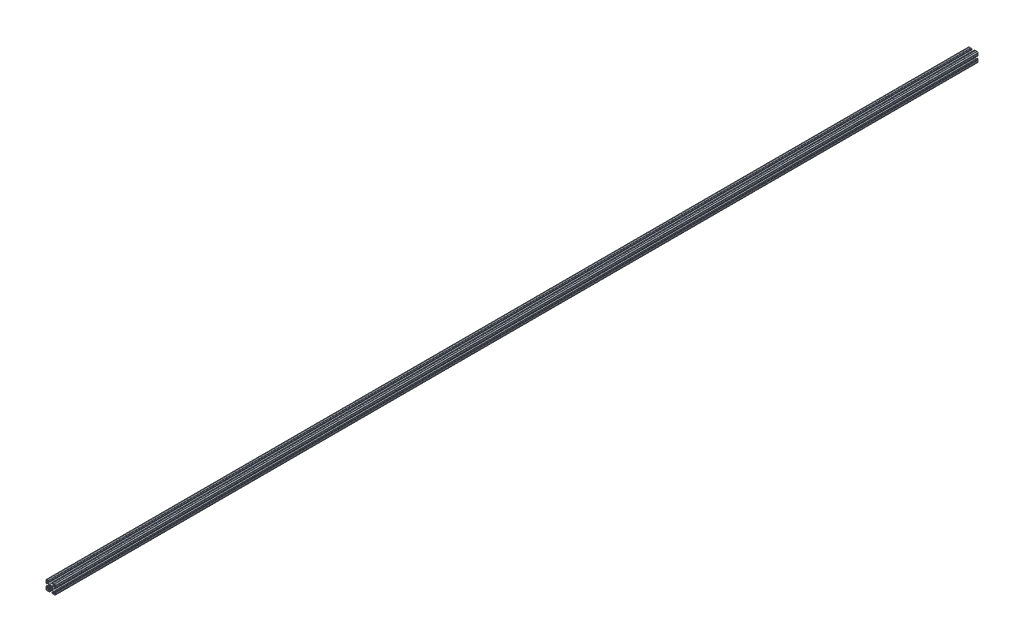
from build123d import *

# Parameters (mm, degrees)
EXTRUDE1_DEPTH = 3683


with BuildPart() as part:
    # Sketch1 → Extrude1 (new body)
    with BuildSketch(Plane.XY):
        with BuildLine():
            Line((6.349777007, -14.984831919), (5.653061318, -14.984831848))
            ThreePointArc((5.653061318, -14.984831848), (4.539002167, -15.446080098), (4.077754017, -16.560139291))
            Line((4.077754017, -16.560139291), (4.077753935, -17.474692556))
            ThreePointArc((4.077753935, -17.474692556), (4.539002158, -18.588751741), (5.653061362, -19.049999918))
            Line((5.653061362, -19.049999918), (7.975599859, -19.05))
            ThreePointArc((7.975599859, -19.05), (8.737599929, -18.288), (9.4996, -19.05))
            Line((9.4996, -19.05), (14.298091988, -19.05))
            ThreePointArc((14.298091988, -19.05), (15.05987163, -18.288000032), (15.822092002, -19.049559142))
            ThreePointArc((15.822092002, -19.049559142), (18.110316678, -18.129769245), (19.049898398, -15.849599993))
            ThreePointArc((19.049898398, -15.849599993), (18.288000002, -15.087549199), (19.05, -14.3256))
            Line((19.05, -14.3256), (19.05, -9.499600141))
            ThreePointArc((19.05, -9.499600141), (18.288, -8.737600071), (19.05, -7.9756))
            Line((19.05, -7.9756), (19.05, -5.653061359))
            ThreePointArc((19.05, -5.653061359), (18.588751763, -4.53900218), (17.474692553, -4.077754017))
            Line((17.474692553, -4.077754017), (16.560139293, -4.077753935))
            ThreePointArc((16.560139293, -4.077753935), (15.446080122, -4.539002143), (14.98483193, -5.653061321))
            Line((14.98483193, -5.653061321), (14.984831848, -6.349776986))
            ThreePointArc((14.984831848, -6.349776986), (15.096428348, -6.619420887), (15.366075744, -6.731008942))
            Line((15.366075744, -6.731008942), (15.696937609, -6.730998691))
            ThreePointArc((15.696937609, -6.730998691), (15.966583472, -6.842585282), (16.078181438, -7.112226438))
            Line((16.078181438, -7.112226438), (16.078207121, -9.396837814))
            ThreePointArc((16.078207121, -9.396837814), (15.817838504, -10.026619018), (15.188068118, -10.287013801))
            Line((15.188068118, -10.287013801), (12.352560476, -10.287103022))
            ThreePointArc((12.352560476, -10.287103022), (11.865894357, -10.190173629), (11.453520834, -9.914153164))
            Line((11.453520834, -9.914153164), (7.114725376, -5.565926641))
            ThreePointArc((7.114725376, -5.565926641), (6.840134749, -5.154247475), (6.7437254, -4.668876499))
            Line((6.7437254, -4.668876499), (6.7437254, 4.641368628))
            ThreePointArc((6.7437254, 4.641368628), (6.840134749, 5.126739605), (7.114725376, 5.53841877))
            Line((7.114725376, 5.53841877), (11.480968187, 9.914152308))
            ThreePointArc((11.480968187, 9.914152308), (11.89334171, 10.190172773), (12.380007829, 10.287102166))
            Line((12.380007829, 10.287102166), (15.188068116, 10.287014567))
            ThreePointArc((15.188068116, 10.287014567), (15.817838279, 10.026619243), (16.078206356, 9.396837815))
            Line((16.078206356, 9.396837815), (16.078181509, 7.1122265))
            ThreePointArc((16.078181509, 7.1122265), (15.966583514, 6.842585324), (15.696937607, 6.730998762))
            Line((15.696937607, 6.730998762), (15.366075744, 6.731009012))
            ThreePointArc((15.366075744, 6.731009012), (15.096428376, 6.619420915), (14.984831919, 6.349777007))
            Line((14.984831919, 6.349777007), (14.984831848, 5.653061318))
            ThreePointArc((14.984831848, 5.653061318), (15.446080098, 4.539002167), (16.560139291, 4.077754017))
            Line((16.560139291, 4.077754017), (17.474692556, 4.077753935))
            ThreePointArc((17.474692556, 4.077753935), (18.588751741, 4.539002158), (19.049999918, 5.653061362))
            Line((19.049999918, 5.653061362), (19.05, 7.975599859))
            ThreePointArc((19.05, 7.975599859), (18.288, 8.737599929), (19.05, 9.4996))
            Line((19.05, 9.4996), (19.05, 14.298091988))
            ThreePointArc((19.05, 14.298091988), (18.288000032, 15.05987163), (19.049559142, 15.822092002))
            ThreePointArc((19.049559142, 15.822092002), (18.129769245, 18.110316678), (15.849599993, 19.049898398))
            ThreePointArc((15.849599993, 19.049898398), (15.087549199, 18.288000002), (14.3256, 19.05))
            Line((14.3256, 19.05), (9.499600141, 19.05))
            ThreePointArc((9.499600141, 19.05), (8.737600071, 18.288), (7.9756, 19.05))
            Line((7.9756, 19.05), (5.653061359, 19.05))
            ThreePointArc((5.653061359, 19.05), (4.53900218, 18.588751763), (4.077754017, 17.474692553))
            Line((4.077754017, 17.474692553), (4.077753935, 16.560139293))
            ThreePointArc((4.077753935, 16.560139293), (4.539002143, 15.446080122), (5.653061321, 14.98483193))
            Line((5.653061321, 14.98483193), (6.349776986, 14.984831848))
            ThreePointArc((6.349776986, 14.984831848), (6.619420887, 15.096428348), (6.731008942, 15.366075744))
            Line((6.731008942, 15.366075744), (6.730998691, 15.696937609))
            ThreePointArc((6.730998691, 15.696937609), (6.842585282, 15.966583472), (7.112226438, 16.078181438))
            Line((7.112226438, 16.078181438), (9.396837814, 16.078207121))
            ThreePointArc((9.396837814, 16.078207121), (10.026619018, 15.817838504), (10.287013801, 15.188068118))
            Line((10.287013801, 15.188068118), (10.287103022, 12.352560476))
            ThreePointArc((10.287103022, 12.352560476), (10.190173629, 11.865894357), (9.914153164, 11.453520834))
            Line((9.914153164, 11.453520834), (5.565926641, 7.114725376))
            ThreePointArc((5.565926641, 7.114725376), (5.154247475, 6.840134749), (4.668876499, 6.7437254))
            Line((4.668876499, 6.7437254), (-4.641368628, 6.7437254))
            ThreePointArc((-4.641368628, 6.7437254), (-5.126739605, 6.840134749), (-5.53841877, 7.114725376))
            Line((-5.53841877, 7.114725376), (-9.914152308, 11.480968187))
            ThreePointArc((-9.914152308, 11.480968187), (-10.190172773, 11.89334171), (-10.287102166, 12.380007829))
            Line((-10.287102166, 12.380007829), (-10.287014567, 15.188068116))
            ThreePointArc((-10.287014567, 15.188068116), (-10.026619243, 15.817838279), (-9.396837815, 16.078206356))
            Line((-9.396837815, 16.078206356), (-7.1122265, 16.078181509))
            ThreePointArc((-7.1122265, 16.078181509), (-6.842585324, 15.966583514), (-6.730998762, 15.696937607))
            Line((-6.730998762, 15.696937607), (-6.731008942, 15.366075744))
            ThreePointArc((-6.731008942, 15.366075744), (-6.619420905, 15.096428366), (-6.349777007, 14.984831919))
            Line((-6.349777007, 14.984831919), (-5.653061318, 14.984831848))
            ThreePointArc((-5.653061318, 14.984831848), (-4.539002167, 15.446080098), (-4.077754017, 16.560139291))
            Line((-4.077754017, 16.560139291), (-4.077753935, 17.474692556))
            ThreePointArc((-4.077753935, 17.474692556), (-4.539002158, 18.588751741), (-5.653061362, 19.049999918))
            Line((-5.653061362, 19.049999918), (-7.975599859, 19.05))
            ThreePointArc((-7.975599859, 19.05), (-8.737599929, 18.288), (-9.4996, 19.05))
            Line((-9.4996, 19.05), (-14.298091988, 19.05))
            ThreePointArc((-14.298091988, 19.05), (-15.05987163, 18.288000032), (-15.822092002, 19.049559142))
            ThreePointArc((-15.822092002, 19.049559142), (-18.110316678, 18.129769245), (-19.049898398, 15.849599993))
            ThreePointArc((-19.049898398, 15.849599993), (-18.288000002, 15.087549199), (-19.05, 14.3256))
            Line((-19.05, 14.3256), (-19.05, 9.499600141))
            ThreePointArc((-19.05, 9.499600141), (-18.288, 8.737600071), (-19.05, 7.9756))
            Line((-19.05, 7.9756), (-19.05, 5.653061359))
            ThreePointArc((-19.05, 5.653061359), (-18.588751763, 4.53900218), (-17.474692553, 4.077754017))
            Line((-17.474692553, 4.077754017), (-16.560139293, 4.077753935))
            ThreePointArc((-16.560139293, 4.077753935), (-15.446080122, 4.539002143), (-14.98483193, 5.653061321))
            Line((-14.98483193, 5.653061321), (-14.984831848, 6.349776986))
            ThreePointArc((-14.984831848, 6.349776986), (-15.096428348, 6.619420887), (-15.366075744, 6.731008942))
            Line((-15.366075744, 6.731008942), (-15.696937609, 6.730998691))
            ThreePointArc((-15.696937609, 6.730998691), (-15.966583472, 6.842585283), (-16.078181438, 7.112226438))
            Line((-16.078181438, 7.112226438), (-16.078207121, 9.396837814))
            ThreePointArc((-16.078207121, 9.396837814), (-15.817838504, 10.026619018), (-15.188068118, 10.287013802))
            Line((-15.188068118, 10.287013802), (-12.352560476, 10.287103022))
            ThreePointArc((-12.352560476, 10.287103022), (-11.865894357, 10.190173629), (-11.453520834, 9.914153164))
            Line((-11.453520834, 9.914153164), (-7.114725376, 5.565926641))
            ThreePointArc((-7.114725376, 5.565926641), (-6.840134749, 5.154247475), (-6.7437254, 4.668876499))
            Line((-6.7437254, 4.668876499), (-6.7437254, -4.641368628))
            ThreePointArc((-6.7437254, -4.641368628), (-6.840134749, -5.126739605), (-7.114725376, -5.53841877))
            Line((-7.114725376, -5.53841877), (-11.480968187, -9.914152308))
            ThreePointArc((-11.480968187, -9.914152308), (-11.89334171, -10.190172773), (-12.380007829, -10.287102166))
            Line((-12.380007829, -10.287102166), (-15.188068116, -10.287014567))
            ThreePointArc((-15.188068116, -10.287014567), (-15.817838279, -10.026619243), (-16.078206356, -9.396837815))
            Line((-16.078206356, -9.396837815), (-16.078181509, -7.1122265))
            ThreePointArc((-16.078181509, -7.1122265), (-15.966583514, -6.842585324), (-15.696937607, -6.730998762))
            Line((-15.696937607, -6.730998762), (-15.366075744, -6.731009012))
            ThreePointArc((-15.366075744, -6.731009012), (-15.096428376, -6.619420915), (-14.984831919, -6.349777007))
            Line((-14.984831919, -6.349777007), (-14.984831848, -5.653061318))
            ThreePointArc((-14.984831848, -5.653061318), (-15.446080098, -4.539002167), (-16.560139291, -4.077754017))
            Line((-16.560139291, -4.077754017), (-17.474692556, -4.077753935))
            ThreePointArc((-17.474692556, -4.077753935), (-18.588751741, -4.539002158), (-19.049999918, -5.653061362))
            Line((-19.049999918, -5.653061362), (-19.05, -7.975599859))
            ThreePointArc((-19.05, -7.975599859), (-18.288, -8.737599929), (-19.05, -9.4996))
            Line((-19.05, -9.4996), (-19.05, -14.298091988))
            ThreePointArc((-19.05, -14.298091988), (-18.288000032, -15.05987163), (-19.049559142, -15.822092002))
            ThreePointArc((-19.049559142, -15.822092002), (-18.129769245, -18.110316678), (-15.849599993, -19.049898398))
            ThreePointArc((-15.849599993, -19.049898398), (-15.087549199, -18.288000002), (-14.3256, -19.05))
            Line((-14.3256, -19.05), (-9.499600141, -19.05))
            ThreePointArc((-9.499600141, -19.05), (-8.737600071, -18.288), (-7.9756, -19.05))
            Line((-7.9756, -19.05), (-5.653061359, -19.05))
            ThreePointArc((-5.653061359, -19.05), (-4.53900218, -18.588751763), (-4.077754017, -17.474692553))
            Line((-4.077754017, -17.474692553), (-4.077753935, -16.560139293))
            ThreePointArc((-4.077753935, -16.560139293), (-4.539002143, -15.446080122), (-5.653061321, -14.98483193))
            Line((-5.653061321, -14.98483193), (-6.349776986, -14.984831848))
            ThreePointArc((-6.349776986, -14.984831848), (-6.619420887, -15.096428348), (-6.731008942, -15.366075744))
            Line((-6.731008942, -15.366075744), (-6.730998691, -15.696937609))
            ThreePointArc((-6.730998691, -15.696937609), (-6.842585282, -15.966583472), (-7.112226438, -16.078181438))
            Line((-7.112226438, -16.078181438), (-9.396837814, -16.078207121))
            ThreePointArc((-9.396837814, -16.078207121), (-10.026619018, -15.817838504), (-10.287013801, -15.188068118))
            Line((-10.287013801, -15.188068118), (-10.287103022, -12.352560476))
            ThreePointArc((-10.287103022, -12.352560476), (-10.190173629, -11.865894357), (-9.914153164, -11.453520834))
            Line((-9.914153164, -11.453520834), (-5.565926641, -7.114725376))
            ThreePointArc((-5.565926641, -7.114725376), (-5.154247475, -6.840134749), (-4.668876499, -6.7437254))
            Line((-4.668876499, -6.7437254), (4.641368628, -6.7437254))
            ThreePointArc((4.641368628, -6.7437254), (5.126739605, -6.840134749), (5.53841877, -7.114725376))
            Line((5.53841877, -7.114725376), (9.914152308, -11.480968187))
            ThreePointArc((9.914152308, -11.480968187), (10.190172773, -11.89334171), (10.287102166, -12.380007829))
            Line((10.287102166, -12.380007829), (10.287014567, -15.188068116))
            ThreePointArc((10.287014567, -15.188068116), (10.026619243, -15.817838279), (9.396837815, -16.078206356))
            Line((9.396837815, -16.078206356), (7.1122265, -16.078181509))
            ThreePointArc((7.1122265, -16.078181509), (6.842585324, -15.966583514), (6.730998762, -15.696937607))
            Line((6.730998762, -15.696937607), (6.731008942, -15.366075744))
            ThreePointArc((6.731008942, -15.366075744), (6.619420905, -15.096428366), (6.349777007, -14.984831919))
        make_face()
        with BuildLine():
            Line((1.582347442, 3.198793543), (3.292097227, 4.908543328))
            ThreePointArc((3.292097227, 4.908543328), (3.580509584, 5.101254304), (3.920715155, 5.1689254))
            Line((3.920715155, 5.1689254), (4.9149254, 5.1689254))
            ThreePointArc((4.9149254, 5.1689254), (5.094530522, 5.094530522), (5.1689254, 4.9149254))
            Line((5.1689254, 4.9149254), (5.1689254, 3.920715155))
            ThreePointArc((5.1689254, 3.920715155), (5.101254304, 3.580509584), (4.908543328, 3.292097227))
            Line((4.908543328, 3.292097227), (3.198793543, 1.582347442))
            ThreePointArc((3.198793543, 1.582347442), (3.095711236, 1.393016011), (3.111879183, 1.178048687))
            ThreePointArc((3.111879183, 1.178048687), (3.3274, 0), (3.111879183, -1.178048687))
            ThreePointArc((3.111879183, -1.178048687), (3.095711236, -1.393016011), (3.198793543, -1.582347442))
            Line((3.198793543, -1.582347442), (4.908543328, -3.292097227))
            ThreePointArc((4.908543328, -3.292097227), (5.101254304, -3.580509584), (5.1689254, -3.920715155))
            Line((5.1689254, -3.920715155), (5.1689254, -4.9149254))
            ThreePointArc((5.1689254, -4.9149254), (5.094530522, -5.094530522), (4.9149254, -5.1689254))
            Line((4.9149254, -5.1689254), (3.920715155, -5.1689254))
            ThreePointArc((3.920715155, -5.1689254), (3.580509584, -5.101254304), (3.292097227, -4.908543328))
            Line((3.292097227, -4.908543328), (1.582347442, -3.198793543))
            ThreePointArc((1.582347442, -3.198793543), (1.393016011, -3.095711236), (1.178048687, -3.111879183))
            ThreePointArc((1.178048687, -3.111879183), (0, -3.3274), (-1.178048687, -3.111879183))
            ThreePointArc((-1.178048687, -3.111879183), (-1.393016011, -3.095711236), (-1.582347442, -3.198793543))
            Line((-1.582347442, -3.198793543), (-3.292097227, -4.908543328))
            ThreePointArc((-3.292097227, -4.908543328), (-3.580509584, -5.101254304), (-3.920715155, -5.1689254))
            Line((-3.920715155, -5.1689254), (-4.9149254, -5.1689254))
            ThreePointArc((-4.9149254, -5.1689254), (-5.094530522, -5.094530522), (-5.1689254, -4.9149254))
            Line((-5.1689254, -4.9149254), (-5.1689254, -3.920715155))
            ThreePointArc((-5.1689254, -3.920715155), (-5.101254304, -3.580509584), (-4.908543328, -3.292097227))
            Line((-4.908543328, -3.292097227), (-3.198793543, -1.582347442))
            ThreePointArc((-3.198793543, -1.582347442), (-3.095711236, -1.393016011), (-3.111879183, -1.178048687))
            ThreePointArc((-3.111879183, -1.178048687), (-3.3274, 0), (-3.111879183, 1.178048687))
            ThreePointArc((-3.111879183, 1.178048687), (-3.095711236, 1.393016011), (-3.198793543, 1.582347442))
            Line((-3.198793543, 1.582347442), (-4.908543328, 3.292097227))
            ThreePointArc((-4.908543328, 3.292097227), (-5.101254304, 3.580509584), (-5.1689254, 3.920715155))
            Line((-5.1689254, 3.920715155), (-5.1689254, 4.9149254))
            ThreePointArc((-5.1689254, 4.9149254), (-5.094530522, 5.094530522), (-4.9149254, 5.1689254))
            Line((-4.9149254, 5.1689254), (-3.920715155, 5.1689254))
            ThreePointArc((-3.920715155, 5.1689254), (-3.580509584, 5.101254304), (-3.292097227, 4.908543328))
            Line((-3.292097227, 4.908543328), (-1.582347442, 3.198793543))
            ThreePointArc((-1.582347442, 3.198793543), (-1.393016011, 3.095711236), (-1.178048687, 3.111879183))
            ThreePointArc((-1.178048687, 3.111879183), (0, 3.3274), (1.178048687, 3.111879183))
            ThreePointArc((1.178048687, 3.111879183), (1.393016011, 3.095711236), (1.582347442, 3.198793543))
        make_face(mode=Mode.SUBTRACT)
        with BuildLine():
            Line((-11.8669054, 14.019430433), (-11.8669054, 12.24788))
            ThreePointArc((-11.8669054, 12.24788), (-11.978497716, 11.978472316), (-12.2479054, 11.86688))
            Line((-12.2479054, 11.86688), (-14.019455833, 11.86688))
            ThreePointArc((-14.019455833, 11.86688), (-14.020427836, 11.867073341), (-14.021251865, 11.867623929))
            Line((-14.021251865, 11.867623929), (-14.557512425, 12.403872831))
            ThreePointArc((-14.557512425, 12.403872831), (-14.559308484, 12.404616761), (-14.561104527, 12.403872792))
            Line((-14.561104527, 12.403872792), (-15.097341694, 11.867623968))
            ThreePointArc((-15.097341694, 11.867623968), (-15.098165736, 11.867073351), (-15.099137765, 11.86688))
            Line((-15.099137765, 11.86688), (-16.8707054, 11.86688))
            ThreePointArc((-16.8707054, 11.86688), (-17.140113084, 11.978472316), (-17.2517054, 12.24788))
            Line((-17.2517054, 12.24788), (-17.2517054, 14.45768))
            ThreePointArc((-17.2517054, 14.45768), (-16.433361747, 16.433336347), (-14.4577054, 17.25168))
            Line((-14.4577054, 17.25168), (-12.2479054, 17.25168))
            ThreePointArc((-12.2479054, 17.25168), (-11.978497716, 17.140087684), (-11.8669054, 16.87068))
            Line((-11.8669054, 16.87068), (-11.8669054, 15.099112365))
            ThreePointArc((-11.8669054, 15.099112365), (-11.867098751, 15.098140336), (-11.867649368, 15.097316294))
            Line((-11.867649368, 15.097316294), (-12.403898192, 14.561079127))
            ThreePointArc((-12.403898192, 14.561079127), (-12.40464216, 14.559283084), (-12.403898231, 14.557487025))
            Line((-12.403898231, 14.557487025), (-11.867649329, 14.021226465))
            ThreePointArc((-11.867649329, 14.021226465), (-11.867098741, 14.020402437), (-11.8669054, 14.019430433))
        make_face(mode=Mode.SUBTRACT)
        with BuildLine():
            Line((-14.019430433, -11.8669054), (-12.24788, -11.8669054))
            ThreePointArc((-12.24788, -11.8669054), (-11.978472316, -11.978497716), (-11.86688, -12.2479054))
            Line((-11.86688, -12.2479054), (-11.86688, -14.019455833))
            ThreePointArc((-11.86688, -14.019455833), (-11.867073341, -14.020427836), (-11.867623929, -14.021251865))
            Line((-11.867623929, -14.021251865), (-12.403872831, -14.557512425))
            ThreePointArc((-12.403872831, -14.557512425), (-12.404616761, -14.559308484), (-12.403872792, -14.561104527))
            Line((-12.403872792, -14.561104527), (-11.867623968, -15.097341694))
            ThreePointArc((-11.867623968, -15.097341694), (-11.867073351, -15.098165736), (-11.86688, -15.099137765))
            Line((-11.86688, -15.099137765), (-11.86688, -16.8707054))
            ThreePointArc((-11.86688, -16.8707054), (-11.978472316, -17.140113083), (-12.24788, -17.2517054))
            Line((-12.24788, -17.2517054), (-14.45768, -17.2517054))
            ThreePointArc((-14.45768, -17.2517054), (-16.433336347, -16.433361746), (-17.25168, -14.4577054))
            Line((-17.25168, -14.4577054), (-17.25168, -12.2479054))
            ThreePointArc((-17.25168, -12.2479054), (-17.140087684, -11.978497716), (-16.87068, -11.8669054))
            Line((-16.87068, -11.8669054), (-15.099112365, -11.8669054))
            ThreePointArc((-15.099112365, -11.8669054), (-15.098140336, -11.867098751), (-15.097316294, -11.867649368))
            Line((-15.097316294, -11.867649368), (-14.561079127, -12.403898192))
            ThreePointArc((-14.561079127, -12.403898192), (-14.559283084, -12.40464216), (-14.557487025, -12.403898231))
            Line((-14.557487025, -12.403898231), (-14.021226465, -11.867649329))
            ThreePointArc((-14.021226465, -11.867649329), (-14.020402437, -11.867098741), (-14.019430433, -11.8669054))
        make_face(mode=Mode.SUBTRACT)
        with BuildLine():
            Line((11.8669054, -14.019430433), (11.8669054, -12.24788))
            ThreePointArc((11.8669054, -12.24788), (11.978497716, -11.978472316), (12.2479054, -11.86688))
            Line((12.2479054, -11.86688), (14.019455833, -11.86688))
            ThreePointArc((14.019455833, -11.86688), (14.020427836, -11.867073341), (14.021251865, -11.867623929))
            Line((14.021251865, -11.867623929), (14.557512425, -12.403872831))
            ThreePointArc((14.557512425, -12.403872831), (14.559308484, -12.404616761), (14.561104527, -12.403872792))
            Line((14.561104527, -12.403872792), (15.097341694, -11.867623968))
            ThreePointArc((15.097341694, -11.867623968), (15.098165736, -11.867073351), (15.099137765, -11.86688))
            Line((15.099137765, -11.86688), (16.8707054, -11.86688))
            ThreePointArc((16.8707054, -11.86688), (17.140113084, -11.978472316), (17.2517054, -12.24788))
            Line((17.2517054, -12.24788), (17.2517054, -14.45768))
            ThreePointArc((17.2517054, -14.45768), (16.433361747, -16.433336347), (14.4577054, -17.25168))
            Line((14.4577054, -17.25168), (12.2479054, -17.25168))
            ThreePointArc((12.2479054, -17.25168), (11.978497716, -17.140087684), (11.8669054, -16.87068))
            Line((11.8669054, -16.87068), (11.8669054, -15.099112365))
            ThreePointArc((11.8669054, -15.099112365), (11.867098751, -15.098140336), (11.867649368, -15.097316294))
            Line((11.867649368, -15.097316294), (12.403898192, -14.561079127))
            ThreePointArc((12.403898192, -14.561079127), (12.40464216, -14.559283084), (12.403898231, -14.557487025))
            Line((12.403898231, -14.557487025), (11.867649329, -14.021226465))
            ThreePointArc((11.867649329, -14.021226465), (11.867098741, -14.020402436), (11.8669054, -14.019430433))
        make_face(mode=Mode.SUBTRACT)
        with BuildLine():
            Line((14.019430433, 11.8669054), (12.24788, 11.8669054))
            ThreePointArc((12.24788, 11.8669054), (11.978472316, 11.978497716), (11.86688, 12.2479054))
            Line((11.86688, 12.2479054), (11.86688, 14.019455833))
            ThreePointArc((11.86688, 14.019455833), (11.867073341, 14.020427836), (11.867623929, 14.021251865))
            Line((11.867623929, 14.021251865), (12.403872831, 14.557512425))
            ThreePointArc((12.403872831, 14.557512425), (12.404616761, 14.559308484), (12.403872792, 14.561104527))
            Line((12.403872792, 14.561104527), (11.867623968, 15.097341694))
            ThreePointArc((11.867623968, 15.097341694), (11.867073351, 15.098165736), (11.86688, 15.099137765))
            Line((11.86688, 15.099137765), (11.86688, 16.8707054))
            ThreePointArc((11.86688, 16.8707054), (11.978472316, 17.140113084), (12.24788, 17.2517054))
            Line((12.24788, 17.2517054), (14.45768, 17.2517054))
            ThreePointArc((14.45768, 17.2517054), (16.433336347, 16.433361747), (17.25168, 14.4577054))
            Line((17.25168, 14.4577054), (17.25168, 12.2479054))
            ThreePointArc((17.25168, 12.2479054), (17.140087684, 11.978497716), (16.87068, 11.8669054))
            Line((16.87068, 11.8669054), (15.099112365, 11.8669054))
            ThreePointArc((15.099112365, 11.8669054), (15.098140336, 11.867098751), (15.097316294, 11.867649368))
            Line((15.097316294, 11.867649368), (14.561079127, 12.403898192))
            ThreePointArc((14.561079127, 12.403898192), (14.559283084, 12.404642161), (14.557487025, 12.403898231))
            Line((14.557487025, 12.403898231), (14.021226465, 11.867649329))
            ThreePointArc((14.021226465, 11.867649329), (14.020402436, 11.867098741), (14.019430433, 11.8669054))
        make_face(mode=Mode.SUBTRACT)
    extrude(amount=-EXTRUDE1_DEPTH)


solid = part.part
